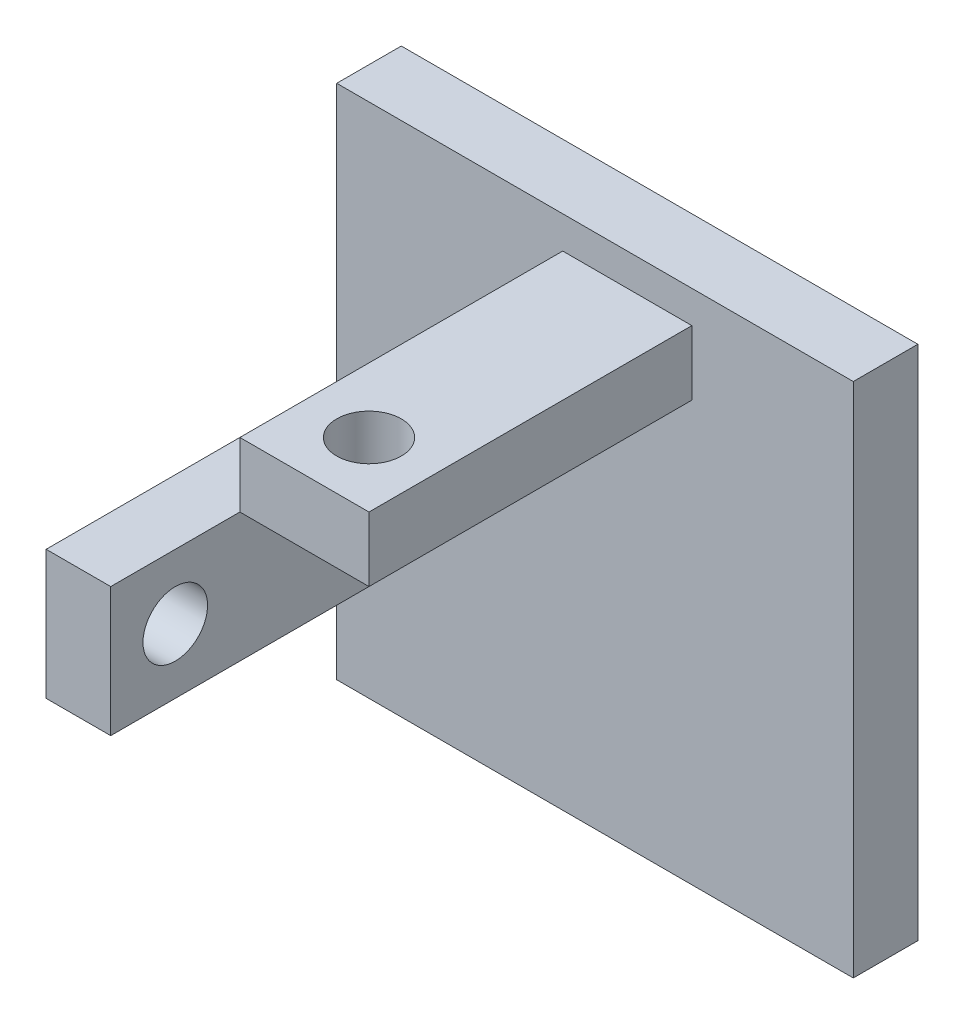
ISO-10303-21;
HEADER;
FILE_DESCRIPTION(('STEP AP214'),'2;1');
FILE_NAME('part.step','',(''),(''),'','','');
FILE_SCHEMA(('AUTOMOTIVE_DESIGN { 1 0 10303 214 1 1 1 1 }'));
ENDSEC;
DATA;
#1=APPLICATION_CONTEXT('core data for automotive mechanical design processes');
#2=APPLICATION_PROTOCOL_DEFINITION('international standard','automotive_design',2000,#1);
#3=PRODUCT_CONTEXT('',#1,'mechanical');
#4=PRODUCT('Part','Part','',(#3));
#5=PRODUCT_RELATED_PRODUCT_CATEGORY('part','',(#4));
#6=PRODUCT_DEFINITION_FORMATION('','',#4);
#7=PRODUCT_DEFINITION_CONTEXT('part definition',#1,'design');
#8=PRODUCT_DEFINITION('design','',#6,#7);
#9=PRODUCT_DEFINITION_SHAPE('','',#8);
#10=(LENGTH_UNIT() NAMED_UNIT(*) SI_UNIT(.MILLI.,.METRE.));
#11=(NAMED_UNIT(*) PLANE_ANGLE_UNIT() SI_UNIT($,.RADIAN.));
#12=(NAMED_UNIT(*) SI_UNIT($,.STERADIAN.) SOLID_ANGLE_UNIT());
#13=UNCERTAINTY_MEASURE_WITH_UNIT(LENGTH_MEASURE(1.E-05),#10,'distance_accuracy_value','');
#14=(GEOMETRIC_REPRESENTATION_CONTEXT(3) GLOBAL_UNCERTAINTY_ASSIGNED_CONTEXT((#13)) GLOBAL_UNIT_ASSIGNED_CONTEXT((#10,
#11,#12)) REPRESENTATION_CONTEXT('',''));
#15=CARTESIAN_POINT('',(0.,0.,0.));
#16=DIRECTION('',(0.,0.,1.));
#17=DIRECTION('',(1.,0.,0.));
#18=AXIS2_PLACEMENT_3D('',#15,#16,#17);
#19=CARTESIAN_POINT('',(14.692052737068,40.307947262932,107.867840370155));
#20=DIRECTION('',(0.,1.,0.));
#21=DIRECTION('',(-1.,0.,0.));
#22=AXIS2_PLACEMENT_3D('',#19,#20,#21);
#23=CYLINDRICAL_SURFACE('',#22,12.5);
#24=CARTESIAN_POINT('',(14.692052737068,40.307947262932,107.867840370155));
#25=DIRECTION('',(0.,1.,0.));
#26=DIRECTION('',(-1.,0.,0.));
#27=AXIS2_PLACEMENT_3D('',#24,#25,#26);
#28=CIRCLE('',#27,12.5);
#29=CARTESIAN_POINT('',(2.19205273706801,40.307947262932,107.867840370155));
#30=VERTEX_POINT('',#29);
#31=EDGE_CURVE('E35',#30,#30,#28,.T.);
#32=ORIENTED_EDGE('',*,*,#31,.F.);
#33=EDGE_LOOP('',(#32));
#34=FACE_BOUND('',#33,.T.);
#35=CARTESIAN_POINT('',(14.692052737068,65.307947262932,107.867840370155));
#36=DIRECTION('',(0.,1.,0.));
#37=DIRECTION('',(-1.,0.,0.));
#38=AXIS2_PLACEMENT_3D('',#35,#36,#37);
#39=CIRCLE('',#38,12.5);
#40=CARTESIAN_POINT('',(2.19205273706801,65.307947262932,107.867840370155));
#41=VERTEX_POINT('',#40);
#42=EDGE_CURVE('E176',#41,#41,#39,.F.);
#43=ORIENTED_EDGE('',*,*,#42,.F.);
#44=EDGE_LOOP('',(#43));
#45=FACE_BOUND('',#44,.T.);
#46=ADVANCED_FACE('F31',(#34,#45),#23,.F.);
#47=CARTESIAN_POINT('',(14.692052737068,52.807947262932,132.867840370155));
#48=DIRECTION('',(0.,0.,1.));
#49=DIRECTION('',(1.,0.,0.));
#50=AXIS2_PLACEMENT_3D('',#47,#48,#49);
#51=PLANE('',#50);
#52=DIRECTION('',(0.,-1.,0.));
#53=VECTOR('',#52,1.);
#54=CARTESIAN_POINT('',(-10.307947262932,40.307947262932,132.867840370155));
#55=LINE('',#54,#53);
#56=CARTESIAN_POINT('',(-10.307947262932,40.307947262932,132.867840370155));
#57=VERTEX_POINT('',#56);
#58=CARTESIAN_POINT('',(-10.307947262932,65.307947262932,132.867840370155));
#59=VERTEX_POINT('',#58);
#60=EDGE_CURVE('E167',#57,#59,#55,.F.);
#61=ORIENTED_EDGE('',*,*,#60,.F.);
#62=DIRECTION('',(1.,0.,0.));
#63=VECTOR('',#62,1.);
#64=CARTESIAN_POINT('',(39.692052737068,40.307947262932,132.867840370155));
#65=LINE('',#64,#63);
#66=CARTESIAN_POINT('',(39.692052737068,40.307947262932,132.867840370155));
#67=VERTEX_POINT('',#66);
#68=EDGE_CURVE('E164',#67,#57,#65,.F.);
#69=ORIENTED_EDGE('',*,*,#68,.F.);
#70=DIRECTION('',(0.,1.,0.));
#71=VECTOR('',#70,1.);
#72=CARTESIAN_POINT('',(39.692052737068,65.307947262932,132.867840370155));
#73=LINE('',#72,#71);
#74=CARTESIAN_POINT('',(39.692052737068,65.307947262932,132.867840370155));
#75=VERTEX_POINT('',#74);
#76=EDGE_CURVE('E150',#75,#67,#73,.F.);
#77=ORIENTED_EDGE('',*,*,#76,.F.);
#78=DIRECTION('',(1.,0.,0.));
#79=VECTOR('',#78,1.);
#80=CARTESIAN_POINT('',(-10.307947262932,65.307947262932,132.867840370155));
#81=LINE('',#80,#79);
#82=EDGE_CURVE('E183',#59,#75,#81,.T.);
#83=ORIENTED_EDGE('',*,*,#82,.F.);
#84=EDGE_LOOP('',(#61,#69,#77,#83));
#85=FACE_BOUND('',#84,.T.);
#86=ADVANCED_FACE('F170',(#85),#51,.T.);
#87=CARTESIAN_POINT('',(2.192052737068,-22.192052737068,-17.1321596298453));
#88=DIRECTION('',(0.,0.,1.));
#89=DIRECTION('',(1.,0.,0.));
#90=AXIS2_PLACEMENT_3D('',#87,#88,#89);
#91=PLANE('',#90);
#92=DIRECTION('',(0.,1.,0.));
#93=VECTOR('',#92,1.);
#94=CARTESIAN_POINT('',(102.192052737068,77.807947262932,-17.1321596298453));
#95=LINE('',#94,#93);
#96=CARTESIAN_POINT('',(102.192052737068,-122.192052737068,-17.1321596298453));
#97=VERTEX_POINT('',#96);
#98=CARTESIAN_POINT('',(102.192052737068,77.807947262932,-17.1321596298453));
#99=VERTEX_POINT('',#98);
#100=EDGE_CURVE('E181',#97,#99,#95,.T.);
#101=ORIENTED_EDGE('',*,*,#100,.F.);
#102=DIRECTION('',(1.,0.,0.));
#103=VECTOR('',#102,1.);
#104=CARTESIAN_POINT('',(102.192052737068,-122.192052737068,-17.1321596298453));
#105=LINE('',#104,#103);
#106=CARTESIAN_POINT('',(-97.807947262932,-122.192052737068,-17.1321596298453));
#107=VERTEX_POINT('',#106);
#108=EDGE_CURVE('E127',#107,#97,#105,.T.);
#109=ORIENTED_EDGE('',*,*,#108,.F.);
#110=DIRECTION('',(0.,-1.,0.));
#111=VECTOR('',#110,1.);
#112=CARTESIAN_POINT('',(-97.807947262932,-122.192052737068,-17.1321596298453));
#113=LINE('',#112,#111);
#114=CARTESIAN_POINT('',(-97.807947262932,77.807947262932,-17.1321596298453));
#115=VERTEX_POINT('',#114);
#116=EDGE_CURVE('E192',#115,#107,#113,.T.);
#117=ORIENTED_EDGE('',*,*,#116,.F.);
#118=DIRECTION('',(1.,0.,0.));
#119=VECTOR('',#118,1.);
#120=CARTESIAN_POINT('',(-97.807947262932,77.807947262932,-17.1321596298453));
#121=LINE('',#120,#119);
#122=EDGE_CURVE('E187',#99,#115,#121,.F.);
#123=ORIENTED_EDGE('',*,*,#122,.F.);
#124=EDGE_LOOP('',(#101,#109,#117,#123));
#125=FACE_BOUND('',#124,.T.);
#126=ADVANCED_FACE('F248',(#125),#91,.F.);
#127=CARTESIAN_POINT('',(39.692052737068,65.307947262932,7.86784037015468));
#128=DIRECTION('',(1.,0.,0.));
#129=DIRECTION('',(0.,0.,-1.));
#130=AXIS2_PLACEMENT_3D('',#127,#128,#129);
#131=PLANE('',#130);
#132=DIRECTION('',(0.,1.,0.));
#133=VECTOR('',#132,1.);
#134=CARTESIAN_POINT('',(39.692052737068,-22.192052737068,7.86784037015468));
#135=LINE('',#134,#133);
#136=CARTESIAN_POINT('',(39.692052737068,65.307947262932,7.86784037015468));
#137=VERTEX_POINT('',#136);
#138=CARTESIAN_POINT('',(39.692052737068,40.307947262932,7.86784037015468));
#139=VERTEX_POINT('',#138);
#140=EDGE_CURVE('E202',#137,#139,#135,.F.);
#141=ORIENTED_EDGE('',*,*,#140,.F.);
#142=DIRECTION('',(0.,0.,1.));
#143=VECTOR('',#142,1.);
#144=CARTESIAN_POINT('',(39.692052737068,65.307947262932,7.86784037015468));
#145=LINE('',#144,#143);
#146=EDGE_CURVE('E120',#75,#137,#145,.F.);
#147=ORIENTED_EDGE('',*,*,#146,.F.);
#148=ORIENTED_EDGE('',*,*,#76,.T.);
#149=DIRECTION('',(0.,0.,1.));
#150=VECTOR('',#149,1.);
#151=CARTESIAN_POINT('',(39.692052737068,40.307947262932,7.86784037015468));
#152=LINE('',#151,#150);
#153=EDGE_CURVE('E154',#139,#67,#152,.T.);
#154=ORIENTED_EDGE('',*,*,#153,.F.);
#155=EDGE_LOOP('',(#141,#147,#148,#154));
#156=FACE_BOUND('',#155,.T.);
#157=ADVANCED_FACE('F153',(#156),#131,.T.);
#158=CARTESIAN_POINT('',(39.692052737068,40.307947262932,7.86784037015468));
#159=DIRECTION('',(0.,-1.,0.));
#160=DIRECTION('',(1.,0.,0.));
#161=AXIS2_PLACEMENT_3D('',#158,#159,#160);
#162=PLANE('',#161);
#163=DIRECTION('',(1.,0.,0.));
#164=VECTOR('',#163,1.);
#165=CARTESIAN_POINT('',(2.192052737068,40.307947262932,7.86784037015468));
#166=LINE('',#165,#164);
#167=CARTESIAN_POINT('',(-10.307947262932,40.307947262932,7.86784037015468));
#168=VERTEX_POINT('',#167);
#169=EDGE_CURVE('E166',#139,#168,#166,.F.);
#170=ORIENTED_EDGE('',*,*,#169,.F.);
#171=ORIENTED_EDGE('',*,*,#153,.T.);
#172=ORIENTED_EDGE('',*,*,#68,.T.);
#173=DIRECTION('',(0.,0.,1.));
#174=VECTOR('',#173,1.);
#175=CARTESIAN_POINT('',(-10.307947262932,40.307947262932,7.86784037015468));
#176=LINE('',#175,#174);
#177=EDGE_CURVE('E174',#168,#57,#176,.T.);
#178=ORIENTED_EDGE('',*,*,#177,.F.);
#179=EDGE_LOOP('',(#170,#171,#172,#178));
#180=FACE_BOUND('',#179,.T.);
#181=ORIENTED_EDGE('',*,*,#31,.T.);
#182=EDGE_LOOP('',(#181));
#183=FACE_BOUND('',#182,.T.);
#184=ADVANCED_FACE('F161',(#180,#183),#162,.T.);
#185=CARTESIAN_POINT('',(-10.307947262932,40.307947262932,7.86784037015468));
#186=DIRECTION('',(-1.,0.,0.));
#187=DIRECTION('',(0.,-1.,0.));
#188=AXIS2_PLACEMENT_3D('',#185,#186,#187);
#189=PLANE('',#188);
#190=DIRECTION('',(0.,1.,0.));
#191=VECTOR('',#190,1.);
#192=CARTESIAN_POINT('',(-10.307947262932,-22.192052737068,7.86784037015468));
#193=LINE('',#192,#191);
#194=CARTESIAN_POINT('',(-10.307947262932,65.307947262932,7.86784037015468));
#195=VERTEX_POINT('',#194);
#196=EDGE_CURVE('E213',#168,#195,#193,.T.);
#197=ORIENTED_EDGE('',*,*,#196,.F.);
#198=ORIENTED_EDGE('',*,*,#177,.T.);
#199=ORIENTED_EDGE('',*,*,#60,.T.);
#200=DIRECTION('',(0.,0.,1.));
#201=VECTOR('',#200,1.);
#202=CARTESIAN_POINT('',(-10.307947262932,65.307947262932,7.86784037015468));
#203=LINE('',#202,#201);
#204=EDGE_CURVE('E178',#195,#59,#203,.T.);
#205=ORIENTED_EDGE('',*,*,#204,.F.);
#206=EDGE_LOOP('',(#197,#198,#199,#205));
#207=FACE_BOUND('',#206,.T.);
#208=ADVANCED_FACE('F298',(#207),#189,.T.);
#209=CARTESIAN_POINT('',(-10.307947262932,65.307947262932,7.86784037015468));
#210=DIRECTION('',(0.,1.,0.));
#211=DIRECTION('',(0.,0.,1.));
#212=AXIS2_PLACEMENT_3D('',#209,#210,#211);
#213=PLANE('',#212);
#214=DIRECTION('',(1.,0.,0.));
#215=VECTOR('',#214,1.);
#216=CARTESIAN_POINT('',(2.192052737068,65.307947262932,7.86784037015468));
#217=LINE('',#216,#215);
#218=EDGE_CURVE('E211',#195,#137,#217,.T.);
#219=ORIENTED_EDGE('',*,*,#218,.F.);
#220=ORIENTED_EDGE('',*,*,#204,.T.);
#221=ORIENTED_EDGE('',*,*,#82,.T.);
#222=ORIENTED_EDGE('',*,*,#146,.T.);
#223=EDGE_LOOP('',(#219,#220,#221,#222));
#224=FACE_BOUND('',#223,.T.);
#225=ORIENTED_EDGE('',*,*,#42,.T.);
#226=EDGE_LOOP('',(#225));
#227=FACE_BOUND('',#226,.T.);
#228=ADVANCED_FACE('F240',(#224,#227),#213,.T.);
#229=CARTESIAN_POINT('',(102.192052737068,77.807947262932,-17.1321596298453));
#230=DIRECTION('',(1.,0.,0.));
#231=DIRECTION('',(0.,0.,-1.));
#232=AXIS2_PLACEMENT_3D('',#229,#230,#231);
#233=PLANE('',#232);
#234=ORIENTED_EDGE('',*,*,#100,.T.);
#235=DIRECTION('',(0.,0.,1.));
#236=VECTOR('',#235,1.);
#237=CARTESIAN_POINT('',(102.192052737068,77.807947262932,-17.1321596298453));
#238=LINE('',#237,#236);
#239=CARTESIAN_POINT('',(102.192052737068,77.807947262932,7.86784037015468));
#240=VERTEX_POINT('',#239);
#241=EDGE_CURVE('E186',#240,#99,#238,.F.);
#242=ORIENTED_EDGE('',*,*,#241,.F.);
#243=DIRECTION('',(0.,1.,0.));
#244=VECTOR('',#243,1.);
#245=CARTESIAN_POINT('',(102.192052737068,-22.192052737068,7.86784037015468));
#246=LINE('',#245,#244);
#247=CARTESIAN_POINT('',(102.192052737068,-122.192052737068,7.86784037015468));
#248=VERTEX_POINT('',#247);
#249=EDGE_CURVE('E208',#248,#240,#246,.T.);
#250=ORIENTED_EDGE('',*,*,#249,.F.);
#251=DIRECTION('',(0.,0.,1.));
#252=VECTOR('',#251,1.);
#253=CARTESIAN_POINT('',(102.192052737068,-122.192052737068,-17.1321596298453));
#254=LINE('',#253,#252);
#255=EDGE_CURVE('E197',#97,#248,#254,.T.);
#256=ORIENTED_EDGE('',*,*,#255,.F.);
#257=EDGE_LOOP('',(#234,#242,#250,#256));
#258=FACE_BOUND('',#257,.T.);
#259=ADVANCED_FACE('F291',(#258),#233,.T.);
#260=CARTESIAN_POINT('',(-97.807947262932,77.807947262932,-17.1321596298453));
#261=DIRECTION('',(0.,1.,0.));
#262=DIRECTION('',(0.,0.,1.));
#263=AXIS2_PLACEMENT_3D('',#260,#261,#262);
#264=PLANE('',#263);
#265=ORIENTED_EDGE('',*,*,#122,.T.);
#266=DIRECTION('',(0.,0.,1.));
#267=VECTOR('',#266,1.);
#268=CARTESIAN_POINT('',(-97.807947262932,77.807947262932,-17.1321596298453));
#269=LINE('',#268,#267);
#270=CARTESIAN_POINT('',(-97.807947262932,77.807947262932,7.86784037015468));
#271=VERTEX_POINT('',#270);
#272=EDGE_CURVE('E189',#271,#115,#269,.F.);
#273=ORIENTED_EDGE('',*,*,#272,.F.);
#274=DIRECTION('',(1.,0.,0.));
#275=VECTOR('',#274,1.);
#276=CARTESIAN_POINT('',(2.192052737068,77.807947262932,7.86784037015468));
#277=LINE('',#276,#275);
#278=EDGE_CURVE('E206',#240,#271,#277,.F.);
#279=ORIENTED_EDGE('',*,*,#278,.F.);
#280=ORIENTED_EDGE('',*,*,#241,.T.);
#281=EDGE_LOOP('',(#265,#273,#279,#280));
#282=FACE_BOUND('',#281,.T.);
#283=ADVANCED_FACE('F287',(#282),#264,.T.);
#284=CARTESIAN_POINT('',(-97.807947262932,-122.192052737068,-17.1321596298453));
#285=DIRECTION('',(-1.,0.,0.));
#286=DIRECTION('',(0.,-1.,0.));
#287=AXIS2_PLACEMENT_3D('',#284,#285,#286);
#288=PLANE('',#287);
#289=ORIENTED_EDGE('',*,*,#116,.T.);
#290=DIRECTION('',(0.,0.,1.));
#291=VECTOR('',#290,1.);
#292=CARTESIAN_POINT('',(-97.807947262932,-122.192052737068,-17.1321596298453));
#293=LINE('',#292,#291);
#294=CARTESIAN_POINT('',(-97.807947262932,-122.192052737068,7.86784037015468));
#295=VERTEX_POINT('',#294);
#296=EDGE_CURVE('E194',#295,#107,#293,.F.);
#297=ORIENTED_EDGE('',*,*,#296,.F.);
#298=DIRECTION('',(0.,1.,0.));
#299=VECTOR('',#298,1.);
#300=CARTESIAN_POINT('',(-97.807947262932,-22.192052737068,7.86784037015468));
#301=LINE('',#300,#299);
#302=EDGE_CURVE('E95',#271,#295,#301,.F.);
#303=ORIENTED_EDGE('',*,*,#302,.F.);
#304=ORIENTED_EDGE('',*,*,#272,.T.);
#305=EDGE_LOOP('',(#289,#297,#303,#304));
#306=FACE_BOUND('',#305,.T.);
#307=ADVANCED_FACE('F284',(#306),#288,.T.);
#308=CARTESIAN_POINT('',(102.192052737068,-122.192052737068,-17.1321596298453));
#309=DIRECTION('',(0.,-1.,0.));
#310=DIRECTION('',(1.,0.,0.));
#311=AXIS2_PLACEMENT_3D('',#308,#309,#310);
#312=PLANE('',#311);
#313=ORIENTED_EDGE('',*,*,#108,.T.);
#314=ORIENTED_EDGE('',*,*,#255,.T.);
#315=DIRECTION('',(1.,0.,0.));
#316=VECTOR('',#315,1.);
#317=CARTESIAN_POINT('',(2.192052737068,-122.192052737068,7.86784037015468));
#318=LINE('',#317,#316);
#319=EDGE_CURVE('E203',#295,#248,#318,.T.);
#320=ORIENTED_EDGE('',*,*,#319,.F.);
#321=ORIENTED_EDGE('',*,*,#296,.T.);
#322=EDGE_LOOP('',(#313,#314,#320,#321));
#323=FACE_BOUND('',#322,.T.);
#324=ADVANCED_FACE('F280',(#323),#312,.T.);
#325=CARTESIAN_POINT('',(-72.807947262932,-34.692052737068,132.867840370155));
#326=DIRECTION('',(0.,0.,1.));
#327=DIRECTION('',(1.,0.,0.));
#328=AXIS2_PLACEMENT_3D('',#325,#326,#327);
#329=PLANE('',#328);
#330=DIRECTION('',(0.,1.,0.));
#331=VECTOR('',#330,1.);
#332=CARTESIAN_POINT('',(-85.307947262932,-59.692052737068,132.867840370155));
#333=LINE('',#332,#331);
#334=CARTESIAN_POINT('',(-85.307947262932,-59.692052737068,132.867840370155));
#335=VERTEX_POINT('',#334);
#336=CARTESIAN_POINT('',(-85.307947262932,-9.69205273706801,132.867840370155));
#337=VERTEX_POINT('',#336);
#338=EDGE_CURVE('E223',#335,#337,#333,.T.);
#339=ORIENTED_EDGE('',*,*,#338,.F.);
#340=DIRECTION('',(1.,0.,0.));
#341=VECTOR('',#340,1.);
#342=CARTESIAN_POINT('',(-60.307947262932,-59.692052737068,132.867840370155));
#343=LINE('',#342,#341);
#344=CARTESIAN_POINT('',(-60.307947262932,-59.692052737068,132.867840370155));
#345=VERTEX_POINT('',#344);
#346=EDGE_CURVE('E63',#345,#335,#343,.F.);
#347=ORIENTED_EDGE('',*,*,#346,.F.);
#348=DIRECTION('',(0.,1.,0.));
#349=VECTOR('',#348,1.);
#350=CARTESIAN_POINT('',(-60.307947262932,-9.69205273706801,132.867840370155));
#351=LINE('',#350,#349);
#352=CARTESIAN_POINT('',(-60.307947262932,-9.69205273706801,132.867840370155));
#353=VERTEX_POINT('',#352);
#354=EDGE_CURVE('E219',#353,#345,#351,.F.);
#355=ORIENTED_EDGE('',*,*,#354,.F.);
#356=DIRECTION('',(1.,0.,0.));
#357=VECTOR('',#356,1.);
#358=CARTESIAN_POINT('',(-85.307947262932,-9.69205273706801,132.867840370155));
#359=LINE('',#358,#357);
#360=EDGE_CURVE('E85',#337,#353,#359,.T.);
#361=ORIENTED_EDGE('',*,*,#360,.F.);
#362=EDGE_LOOP('',(#339,#347,#355,#361));
#363=FACE_BOUND('',#362,.T.);
#364=ADVANCED_FACE('F277',(#363),#329,.T.);
#365=CARTESIAN_POINT('',(-85.307947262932,-9.69205273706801,7.86784037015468));
#366=DIRECTION('',(0.,1.,0.));
#367=DIRECTION('',(0.,0.,1.));
#368=AXIS2_PLACEMENT_3D('',#365,#366,#367);
#369=PLANE('',#368);
#370=DIRECTION('',(1.,0.,0.));
#371=VECTOR('',#370,1.);
#372=CARTESIAN_POINT('',(2.192052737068,-9.69205273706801,7.86784037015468));
#373=LINE('',#372,#371);
#374=CARTESIAN_POINT('',(-85.307947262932,-9.69205273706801,7.86784037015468));
#375=VERTEX_POINT('',#374);
#376=CARTESIAN_POINT('',(-60.307947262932,-9.69205273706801,7.86784037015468));
#377=VERTEX_POINT('',#376);
#378=EDGE_CURVE('E71',#375,#377,#373,.T.);
#379=ORIENTED_EDGE('',*,*,#378,.F.);
#380=DIRECTION('',(0.,0.,1.));
#381=VECTOR('',#380,1.);
#382=CARTESIAN_POINT('',(-85.307947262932,-9.69205273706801,7.86784037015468));
#383=LINE('',#382,#381);
#384=EDGE_CURVE('E233',#337,#375,#383,.F.);
#385=ORIENTED_EDGE('',*,*,#384,.F.);
#386=ORIENTED_EDGE('',*,*,#360,.T.);
#387=DIRECTION('',(0.,0.,-1.));
#388=VECTOR('',#387,1.);
#389=CARTESIAN_POINT('',(-60.307947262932,-9.69205273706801,7.86784037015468));
#390=LINE('',#389,#388);
#391=EDGE_CURVE('E221',#377,#353,#390,.F.);
#392=ORIENTED_EDGE('',*,*,#391,.F.);
#393=EDGE_LOOP('',(#379,#385,#386,#392));
#394=FACE_BOUND('',#393,.T.);
#395=ADVANCED_FACE('F274',(#394),#369,.T.);
#396=CARTESIAN_POINT('',(2.192052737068,-22.192052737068,7.86784037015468));
#397=DIRECTION('',(0.,0.,1.));
#398=DIRECTION('',(1.,0.,0.));
#399=AXIS2_PLACEMENT_3D('',#396,#397,#398);
#400=PLANE('',#399);
#401=ORIENTED_EDGE('',*,*,#302,.T.);
#402=ORIENTED_EDGE('',*,*,#319,.T.);
#403=ORIENTED_EDGE('',*,*,#249,.T.);
#404=ORIENTED_EDGE('',*,*,#278,.T.);
#405=EDGE_LOOP('',(#401,#402,#403,#404));
#406=FACE_BOUND('',#405,.T.);
#407=DIRECTION('',(0.,1.,0.));
#408=VECTOR('',#407,1.);
#409=CARTESIAN_POINT('',(-85.307947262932,-59.692052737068,7.86784037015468));
#410=LINE('',#409,#408);
#411=CARTESIAN_POINT('',(-85.307947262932,-59.692052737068,7.86784037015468));
#412=VERTEX_POINT('',#411);
#413=EDGE_CURVE('E50',#375,#412,#410,.F.);
#414=ORIENTED_EDGE('',*,*,#413,.F.);
#415=ORIENTED_EDGE('',*,*,#378,.T.);
#416=DIRECTION('',(0.,1.,0.));
#417=VECTOR('',#416,1.);
#418=CARTESIAN_POINT('',(-60.307947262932,-9.69205273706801,7.86784037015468));
#419=LINE('',#418,#417);
#420=CARTESIAN_POINT('',(-60.307947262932,-59.692052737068,7.86784037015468));
#421=VERTEX_POINT('',#420);
#422=EDGE_CURVE('E224',#421,#377,#419,.T.);
#423=ORIENTED_EDGE('',*,*,#422,.F.);
#424=DIRECTION('',(1.,0.,0.));
#425=VECTOR('',#424,1.);
#426=CARTESIAN_POINT('',(-60.307947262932,-59.692052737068,7.86784037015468));
#427=LINE('',#426,#425);
#428=EDGE_CURVE('E217',#412,#421,#427,.T.);
#429=ORIENTED_EDGE('',*,*,#428,.F.);
#430=EDGE_LOOP('',(#414,#415,#423,#429));
#431=FACE_BOUND('',#430,.T.);
#432=ORIENTED_EDGE('',*,*,#196,.T.);
#433=ORIENTED_EDGE('',*,*,#218,.T.);
#434=ORIENTED_EDGE('',*,*,#140,.T.);
#435=ORIENTED_EDGE('',*,*,#169,.T.);
#436=EDGE_LOOP('',(#432,#433,#434,#435));
#437=FACE_BOUND('',#436,.T.);
#438=ADVANCED_FACE('F269',(#406,#431,#437),#400,.T.);
#439=CARTESIAN_POINT('',(-60.307947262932,-59.692052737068,7.86784037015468));
#440=DIRECTION('',(0.,-1.,0.));
#441=DIRECTION('',(0.,0.,-1.));
#442=AXIS2_PLACEMENT_3D('',#439,#440,#441);
#443=PLANE('',#442);
#444=ORIENTED_EDGE('',*,*,#428,.T.);
#445=DIRECTION('',(0.,0.,-1.));
#446=VECTOR('',#445,1.);
#447=CARTESIAN_POINT('',(-60.307947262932,-59.692052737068,7.86784037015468));
#448=LINE('',#447,#446);
#449=EDGE_CURVE('E226',#345,#421,#448,.T.);
#450=ORIENTED_EDGE('',*,*,#449,.F.);
#451=ORIENTED_EDGE('',*,*,#346,.T.);
#452=DIRECTION('',(0.,0.,1.));
#453=VECTOR('',#452,1.);
#454=CARTESIAN_POINT('',(-85.307947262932,-59.692052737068,7.86784037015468));
#455=LINE('',#454,#453);
#456=EDGE_CURVE('E230',#412,#335,#455,.T.);
#457=ORIENTED_EDGE('',*,*,#456,.F.);
#458=EDGE_LOOP('',(#444,#450,#451,#457));
#459=FACE_BOUND('',#458,.T.);
#460=ADVANCED_FACE('F263',(#459),#443,.T.);
#461=CARTESIAN_POINT('',(-60.307947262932,-9.69205273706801,7.86784037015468));
#462=DIRECTION('',(1.,0.,0.));
#463=DIRECTION('',(0.,0.,-1.));
#464=AXIS2_PLACEMENT_3D('',#461,#462,#463);
#465=PLANE('',#464);
#466=ORIENTED_EDGE('',*,*,#422,.T.);
#467=ORIENTED_EDGE('',*,*,#391,.T.);
#468=ORIENTED_EDGE('',*,*,#354,.T.);
#469=ORIENTED_EDGE('',*,*,#449,.T.);
#470=EDGE_LOOP('',(#466,#467,#468,#469));
#471=FACE_BOUND('',#470,.T.);
#472=CARTESIAN_POINT('',(-60.307947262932,-34.692052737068,107.867840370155));
#473=DIRECTION('',(-1.,0.,0.));
#474=DIRECTION('',(0.,0.,1.));
#475=AXIS2_PLACEMENT_3D('',#472,#473,#474);
#476=CIRCLE('',#475,12.5);
#477=CARTESIAN_POINT('',(-60.307947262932,-34.692052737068,120.367840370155));
#478=VERTEX_POINT('',#477);
#479=EDGE_CURVE('E41',#478,#478,#476,.T.);
#480=ORIENTED_EDGE('',*,*,#479,.T.);
#481=EDGE_LOOP('',(#480));
#482=FACE_BOUND('',#481,.T.);
#483=ADVANCED_FACE('F257',(#471,#482),#465,.T.);
#484=CARTESIAN_POINT('',(-85.307947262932,-59.692052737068,7.86784037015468));
#485=DIRECTION('',(-1.,0.,0.));
#486=DIRECTION('',(0.,0.,1.));
#487=AXIS2_PLACEMENT_3D('',#484,#485,#486);
#488=PLANE('',#487);
#489=ORIENTED_EDGE('',*,*,#413,.T.);
#490=ORIENTED_EDGE('',*,*,#456,.T.);
#491=ORIENTED_EDGE('',*,*,#338,.T.);
#492=ORIENTED_EDGE('',*,*,#384,.T.);
#493=EDGE_LOOP('',(#489,#490,#491,#492));
#494=FACE_BOUND('',#493,.T.);
#495=CARTESIAN_POINT('',(-85.307947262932,-34.692052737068,107.867840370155));
#496=DIRECTION('',(-1.,0.,0.));
#497=DIRECTION('',(0.,0.,1.));
#498=AXIS2_PLACEMENT_3D('',#495,#496,#497);
#499=CIRCLE('',#498,12.5);
#500=CARTESIAN_POINT('',(-85.307947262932,-34.692052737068,120.367840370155));
#501=VERTEX_POINT('',#500);
#502=EDGE_CURVE('E11',#501,#501,#499,.F.);
#503=ORIENTED_EDGE('',*,*,#502,.T.);
#504=EDGE_LOOP('',(#503));
#505=FACE_BOUND('',#504,.T.);
#506=ADVANCED_FACE('F252',(#494,#505),#488,.T.);
#507=CARTESIAN_POINT('',(-60.307947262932,-34.692052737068,107.867840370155));
#508=DIRECTION('',(-1.,0.,0.));
#509=DIRECTION('',(0.,0.,1.));
#510=AXIS2_PLACEMENT_3D('',#507,#508,#509);
#511=CYLINDRICAL_SURFACE('',#510,12.5);
#512=ORIENTED_EDGE('',*,*,#502,.F.);
#513=EDGE_LOOP('',(#512));
#514=FACE_BOUND('',#513,.T.);
#515=ORIENTED_EDGE('',*,*,#479,.F.);
#516=EDGE_LOOP('',(#515));
#517=FACE_BOUND('',#516,.T.);
#518=ADVANCED_FACE('F33',(#514,#517),#511,.F.);
#519=CLOSED_SHELL('',(#46,#86,#126,#157,#184,#208,#228,#259,#283,#307,#324,#364,#395,#438,#460,
#483,#506,#518));
#520=MANIFOLD_SOLID_BREP('B2',#519);
#521=ADVANCED_BREP_SHAPE_REPRESENTATION('',(#18,#520),#14);
#522=SHAPE_DEFINITION_REPRESENTATION(#9,#521);
ENDSEC;
END-ISO-10303-21;
